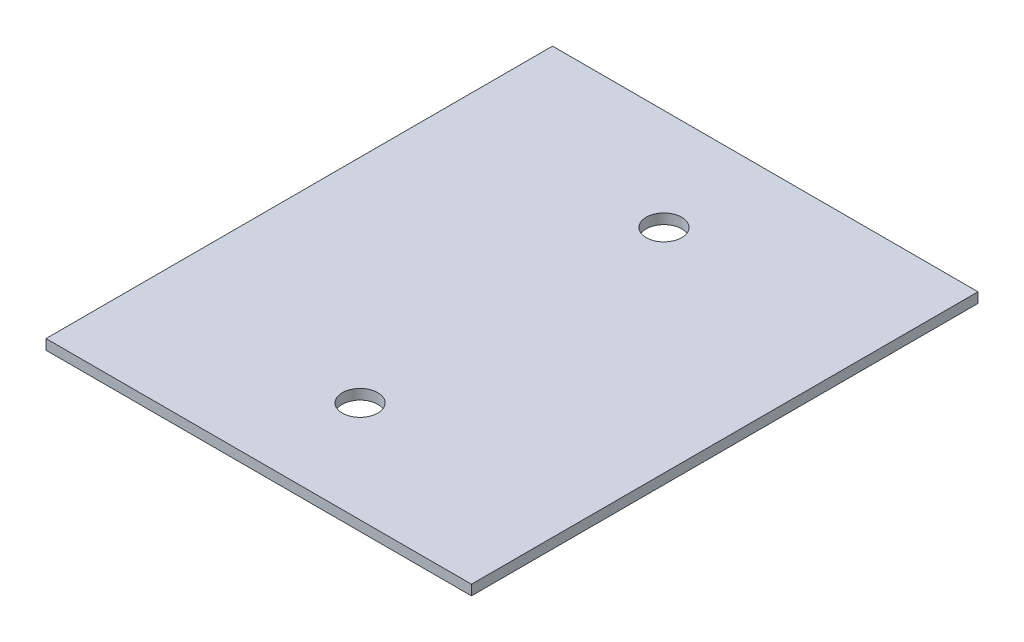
from build123d import *

# Parameters (mm, degrees)
SKETCH1_W           = 42
SKETCH1_H           = 50
SKETCH1_R           = 1.75
BOSS_EXTRUDE1_DEPTH = 1


with BuildPart() as part:
    # Sketch1 → Boss-Extrude1 (new body)
    with BuildSketch(Plane(origin=(0, 0, 0), x_dir=(1, 0, 0), z_dir=(0, 1, 0))):
        with Locations((21, 25)):
            Rectangle(SKETCH1_W, SKETCH1_H)
        with Locations(Location((21, 40, 0), (0, 0, 270))):
            Circle(SKETCH1_R, mode=Mode.SUBTRACT)
        with Locations(Location((21, 10, 0), (0, 0, 270))):
            Circle(SKETCH1_R, mode=Mode.SUBTRACT)
    extrude(amount=BOSS_EXTRUDE1_DEPTH)


solid = part.part
